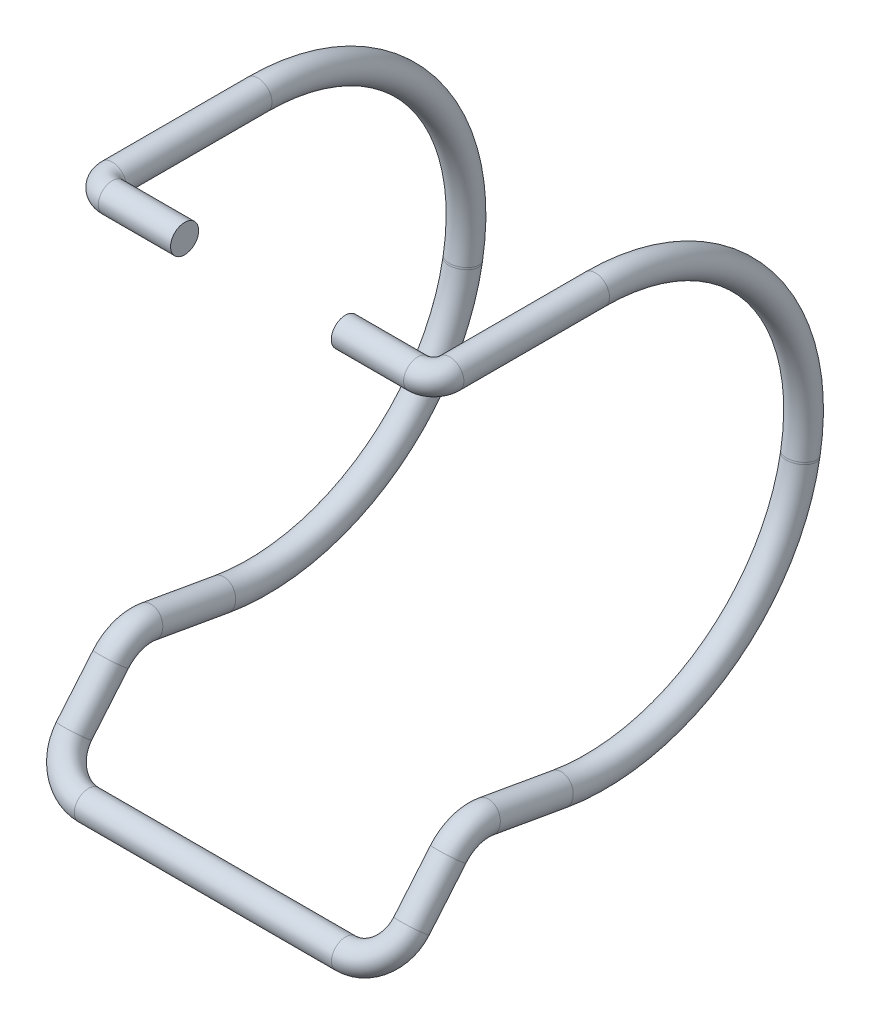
ISO-10303-21;
HEADER;
FILE_DESCRIPTION(('STEP AP214'),'2;1');
FILE_NAME('part.step','',(''),(''),'','','');
FILE_SCHEMA(('AUTOMOTIVE_DESIGN { 1 0 10303 214 1 1 1 1 }'));
ENDSEC;
DATA;
#1=APPLICATION_CONTEXT('core data for automotive mechanical design processes');
#2=APPLICATION_PROTOCOL_DEFINITION('international standard','automotive_design',2000,#1);
#3=PRODUCT_CONTEXT('',#1,'mechanical');
#4=PRODUCT('Part','Part','',(#3));
#5=PRODUCT_RELATED_PRODUCT_CATEGORY('part','',(#4));
#6=PRODUCT_DEFINITION_FORMATION('','',#4);
#7=PRODUCT_DEFINITION_CONTEXT('part definition',#1,'design');
#8=PRODUCT_DEFINITION('design','',#6,#7);
#9=PRODUCT_DEFINITION_SHAPE('','',#8);
#10=(LENGTH_UNIT() NAMED_UNIT(*) SI_UNIT(.MILLI.,.METRE.));
#11=(NAMED_UNIT(*) PLANE_ANGLE_UNIT() SI_UNIT($,.RADIAN.));
#12=(NAMED_UNIT(*) SI_UNIT($,.STERADIAN.) SOLID_ANGLE_UNIT());
#13=UNCERTAINTY_MEASURE_WITH_UNIT(LENGTH_MEASURE(1.E-05),#10,'distance_accuracy_value','');
#14=(GEOMETRIC_REPRESENTATION_CONTEXT(3) GLOBAL_UNCERTAINTY_ASSIGNED_CONTEXT((#13)) GLOBAL_UNIT_ASSIGNED_CONTEXT((#10,
#11,#12)) REPRESENTATION_CONTEXT('',''));
#15=CARTESIAN_POINT('',(0.,0.,0.));
#16=DIRECTION('',(0.,0.,1.));
#17=DIRECTION('',(1.,0.,0.));
#18=AXIS2_PLACEMENT_3D('',#15,#16,#17);
#19=CARTESIAN_POINT('',(19.,0.,0.));
#20=DIRECTION('',(-1.,0.,0.));
#21=DIRECTION('',(0.,0.,1.));
#22=AXIS2_PLACEMENT_3D('',#19,#20,#21);
#23=CYLINDRICAL_SURFACE('',#22,1.75);
#24=CARTESIAN_POINT('',(10.,0.,0.));
#25=DIRECTION('',(1.,0.,0.));
#26=DIRECTION('',(0.,1.,0.));
#27=AXIS2_PLACEMENT_3D('',#24,#25,#26);
#28=CIRCLE('',#27,1.75);
#29=CARTESIAN_POINT('',(10.,1.75,0.));
#30=VERTEX_POINT('',#29);
#31=EDGE_CURVE('E35',#30,#30,#28,.T.);
#32=ORIENTED_EDGE('',*,*,#31,.T.);
#33=EDGE_LOOP('',(#32));
#34=FACE_BOUND('',#33,.T.);
#35=CARTESIAN_POINT('',(19.,0.,0.));
#36=DIRECTION('',(1.,0.,0.));
#37=DIRECTION('',(0.,0.,-1.));
#38=AXIS2_PLACEMENT_3D('',#35,#36,#37);
#39=CIRCLE('',#38,1.75);
#40=CARTESIAN_POINT('',(19.,0.,1.75));
#41=VERTEX_POINT('',#40);
#42=EDGE_CURVE('E52',#41,#41,#39,.T.);
#43=ORIENTED_EDGE('',*,*,#42,.F.);
#44=EDGE_LOOP('',(#43));
#45=FACE_BOUND('',#44,.T.);
#46=ADVANCED_FACE('F31',(#34,#45),#23,.T.);
#47=CARTESIAN_POINT('',(-19.,0.,-2.));
#48=DIRECTION('',(0.,1.,0.));
#49=DIRECTION('',(0.,0.,1.));
#50=AXIS2_PLACEMENT_3D('',#47,#48,#49);
#51=TOROIDAL_SURFACE('',#50,1.99999999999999,1.75);
#52=CARTESIAN_POINT('',(-21.,0.,-1.99999999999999));
#53=DIRECTION('',(0.,0.,1.));
#54=DIRECTION('',(1.,0.,0.));
#55=AXIS2_PLACEMENT_3D('',#52,#53,#54);
#56=CIRCLE('',#55,1.75);
#57=CARTESIAN_POINT('',(-22.75,0.,-1.99999999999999));
#58=VERTEX_POINT('',#57);
#59=EDGE_CURVE('E39',#58,#58,#56,.T.);
#60=CARTESIAN_POINT('',(-19.,0.,0.));
#61=DIRECTION('',(1.,0.,0.));
#62=DIRECTION('',(0.,0.,-1.));
#63=AXIS2_PLACEMENT_3D('',#60,#61,#62);
#64=CIRCLE('',#63,1.75);
#65=CARTESIAN_POINT('',(-19.,0.,1.75));
#66=VERTEX_POINT('',#65);
#67=EDGE_CURVE('E10',#66,#66,#64,.T.);
#68=CARTESIAN_POINT('',(-19.,0.,-2.));
#69=DIRECTION('',(0.,1.,0.));
#70=DIRECTION('',(0.,0.,1.));
#71=AXIS2_PLACEMENT_3D('',#68,#69,#70);
#72=CIRCLE('',#71,3.74999999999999);
#73=EDGE_CURVE('',#58,#66,#72,.T.);
#74=ORIENTED_EDGE('',*,*,#59,.T.);
#75=ORIENTED_EDGE('',*,*,#67,.F.);
#76=ORIENTED_EDGE('',*,*,#73,.T.);
#77=ORIENTED_EDGE('',*,*,#73,.F.);
#78=EDGE_LOOP('',(#74,#76,#75,#77));
#79=FACE_BOUND('',#78,.T.);
#80=ADVANCED_FACE('F33',(#79),#51,.T.);
#81=CARTESIAN_POINT('',(-21.,0.,-20.1191753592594));
#82=DIRECTION('',(0.,0.,1.));
#83=DIRECTION('',(0.,-1.,0.));
#84=AXIS2_PLACEMENT_3D('',#81,#82,#83);
#85=CYLINDRICAL_SURFACE('',#84,1.75);
#86=CARTESIAN_POINT('',(-21.,0.,-20.1191753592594));
#87=DIRECTION('',(0.,0.,1.));
#88=DIRECTION('',(1.,0.,0.));
#89=AXIS2_PLACEMENT_3D('',#86,#87,#88);
#90=CIRCLE('',#89,1.75);
#91=CARTESIAN_POINT('',(-21.,1.75000000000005,-20.1191753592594));
#92=VERTEX_POINT('',#91);
#93=EDGE_CURVE('E44',#92,#92,#90,.T.);
#94=ORIENTED_EDGE('',*,*,#93,.T.);
#95=EDGE_LOOP('',(#94));
#96=FACE_BOUND('',#95,.T.);
#97=ORIENTED_EDGE('',*,*,#59,.F.);
#98=EDGE_LOOP('',(#97));
#99=FACE_BOUND('',#98,.T.);
#100=ADVANCED_FACE('F110',(#96,#99),#85,.T.);
#101=CARTESIAN_POINT('',(-21.,-25.9,-20.1191753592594));
#102=DIRECTION('',(1.,0.,0.));
#103=DIRECTION('',(0.,1.,0.));
#104=AXIS2_PLACEMENT_3D('',#101,#102,#103);
#105=TOROIDAL_SURFACE('',#104,25.9,1.75);
#106=CARTESIAN_POINT('',(-21.,-30.3974878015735,-45.6256961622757));
#107=DIRECTION('',(0.,0.984807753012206,-0.173648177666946));
#108=DIRECTION('',(1.,0.,0.));
#109=AXIS2_PLACEMENT_3D('',#106,#107,#108);
#110=CIRCLE('',#109,1.75);
#111=CARTESIAN_POINT('',(-21.,-30.7013721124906,-47.349109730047));
#112=VERTEX_POINT('',#111);
#113=EDGE_CURVE('E105',#112,#112,#110,.T.);
#114=CARTESIAN_POINT('',(-21.,-25.9,-20.1191753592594));
#115=DIRECTION('',(1.,0.,0.));
#116=DIRECTION('',(0.,1.,0.));
#117=AXIS2_PLACEMENT_3D('',#114,#115,#116);
#118=CIRCLE('',#117,27.65);
#119=EDGE_CURVE('',#112,#92,#118,.T.);
#120=ORIENTED_EDGE('',*,*,#113,.T.);
#121=ORIENTED_EDGE('',*,*,#93,.F.);
#122=ORIENTED_EDGE('',*,*,#119,.T.);
#123=ORIENTED_EDGE('',*,*,#119,.F.);
#124=EDGE_LOOP('',(#120,#122,#121,#123));
#125=FACE_BOUND('',#124,.T.);
#126=ADVANCED_FACE('F113',(#125),#105,.T.);
#127=CARTESIAN_POINT('',(-21.,-30.6133333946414,-45.5876367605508));
#128=DIRECTION('',(0.,0.984807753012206,-0.173648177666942));
#129=DIRECTION('',(0.,0.173648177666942,0.984807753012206));
#130=AXIS2_PLACEMENT_3D('',#127,#128,#129);
#131=CYLINDRICAL_SURFACE('',#130,1.75);
#132=CARTESIAN_POINT('',(-21.,-30.6133333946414,-45.5876367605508));
#133=DIRECTION('',(0.,0.984807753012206,-0.173648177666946));
#134=DIRECTION('',(1.,0.,0.));
#135=AXIS2_PLACEMENT_3D('',#132,#133,#134);
#136=CIRCLE('',#135,1.75);
#137=CARTESIAN_POINT('',(-21.,-30.9172177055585,-47.3110503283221));
#138=VERTEX_POINT('',#137);
#139=EDGE_CURVE('E102',#138,#138,#136,.T.);
#140=ORIENTED_EDGE('',*,*,#139,.T.);
#141=EDGE_LOOP('',(#140));
#142=FACE_BOUND('',#141,.T.);
#143=ORIENTED_EDGE('',*,*,#113,.F.);
#144=EDGE_LOOP('',(#143));
#145=FACE_BOUND('',#144,.T.);
#146=ADVANCED_FACE('F115',(#142,#145),#131,.T.);
#147=CARTESIAN_POINT('',(-21.,-26.1158455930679,-20.0811159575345));
#148=DIRECTION('',(1.,0.,0.));
#149=DIRECTION('',(0.,0.,-1.));
#150=AXIS2_PLACEMENT_3D('',#147,#148,#149);
#151=TOROIDAL_SURFACE('',#150,25.9,1.75);
#152=CARTESIAN_POINT('',(-21.,-51.6223663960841,-15.583628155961));
#153=DIRECTION('',(0.,-0.173648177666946,-0.984807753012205));
#154=DIRECTION('',(1.,0.,0.));
#155=AXIS2_PLACEMENT_3D('',#152,#153,#154);
#156=CIRCLE('',#155,1.75);
#157=CARTESIAN_POINT('',(-21.,-53.3457799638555,-15.2797438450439));
#158=VERTEX_POINT('',#157);
#159=EDGE_CURVE('E99',#158,#158,#156,.T.);
#160=CARTESIAN_POINT('',(-21.,-26.1158455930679,-20.0811159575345));
#161=DIRECTION('',(1.,0.,0.));
#162=DIRECTION('',(0.,0.,-1.));
#163=AXIS2_PLACEMENT_3D('',#160,#161,#162);
#164=CIRCLE('',#163,27.65);
#165=EDGE_CURVE('',#158,#138,#164,.T.);
#166=ORIENTED_EDGE('',*,*,#159,.T.);
#167=ORIENTED_EDGE('',*,*,#139,.F.);
#168=ORIENTED_EDGE('',*,*,#165,.T.);
#169=ORIENTED_EDGE('',*,*,#165,.F.);
#170=EDGE_LOOP('',(#166,#168,#167,#169));
#171=FACE_BOUND('',#170,.T.);
#172=ADVANCED_FACE('F122',(#171),#151,.T.);
#173=CARTESIAN_POINT('',(-21.,-50.0225025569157,-6.51034945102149));
#174=DIRECTION('',(0.,-0.17364817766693,-0.984807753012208));
#175=DIRECTION('',(0.,0.984807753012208,-0.17364817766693));
#176=AXIS2_PLACEMENT_3D('',#173,#174,#175);
#177=CYLINDRICAL_SURFACE('',#176,1.75);
#178=CARTESIAN_POINT('',(-21.,-50.0225025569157,-6.51034945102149));
#179=DIRECTION('',(0.,-0.173648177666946,-0.984807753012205));
#180=DIRECTION('',(1.,0.,0.));
#181=AXIS2_PLACEMENT_3D('',#178,#179,#180);
#182=CIRCLE('',#181,1.75);
#183=CARTESIAN_POINT('',(-21.,-48.2990889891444,-6.81423376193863));
#184=VERTEX_POINT('',#183);
#185=EDGE_CURVE('E96',#184,#184,#182,.T.);
#186=ORIENTED_EDGE('',*,*,#185,.T.);
#187=EDGE_LOOP('',(#186));
#188=FACE_BOUND('',#187,.T.);
#189=ORIENTED_EDGE('',*,*,#159,.F.);
#190=EDGE_LOOP('',(#189));
#191=FACE_BOUND('',#190,.T.);
#192=ADVANCED_FACE('F196',(#188,#191),#177,.T.);
#193=CARTESIAN_POINT('',(-21.,-54.9465413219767,-5.64210856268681));
#194=DIRECTION('',(-1.,0.,0.));
#195=DIRECTION('',(0.,0.,1.));
#196=AXIS2_PLACEMENT_3D('',#193,#194,#195);
#197=TOROIDAL_SURFACE('',#196,4.99999999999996,1.75);
#198=CARTESIAN_POINT('',(-21.,-51.7326032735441,-1.81188634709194));
#199=DIRECTION('',(0.,0.766044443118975,-0.642787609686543));
#200=DIRECTION('',(1.,0.,0.));
#201=AXIS2_PLACEMENT_3D('',#198,#199,#200);
#202=CIRCLE('',#201,1.75);
#203=CARTESIAN_POINT('',(-21.,-50.6077249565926,-0.471308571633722));
#204=VERTEX_POINT('',#203);
#205=EDGE_CURVE('E93',#204,#204,#202,.T.);
#206=CARTESIAN_POINT('',(-21.,-54.9465413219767,-5.64210856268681));
#207=DIRECTION('',(-1.,0.,0.));
#208=DIRECTION('',(0.,0.,1.));
#209=AXIS2_PLACEMENT_3D('',#206,#207,#208);
#210=CIRCLE('',#209,6.74999999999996);
#211=EDGE_CURVE('',#204,#184,#210,.T.);
#212=ORIENTED_EDGE('',*,*,#205,.T.);
#213=ORIENTED_EDGE('',*,*,#185,.F.);
#214=ORIENTED_EDGE('',*,*,#211,.T.);
#215=ORIENTED_EDGE('',*,*,#211,.F.);
#216=EDGE_LOOP('',(#212,#214,#213,#215));
#217=FACE_BOUND('',#216,.T.);
#218=ADVANCED_FACE('F192',(#217),#197,.T.);
#219=CARTESIAN_POINT('',(-21.,-57.181667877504,2.76042175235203));
#220=DIRECTION('',(0.,0.766044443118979,-0.642787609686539));
#221=DIRECTION('',(0.,0.642787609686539,0.766044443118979));
#222=AXIS2_PLACEMENT_3D('',#219,#220,#221);
#223=CYLINDRICAL_SURFACE('',#222,1.75);
#224=CARTESIAN_POINT('',(-21.,-57.181667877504,2.76042175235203));
#225=DIRECTION('',(0.,0.766044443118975,-0.642787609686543));
#226=DIRECTION('',(1.,0.,0.));
#227=AXIS2_PLACEMENT_3D('',#224,#225,#226);
#228=CIRCLE('',#227,1.75);
#229=CARTESIAN_POINT('',(-22.75,-57.181667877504,2.76042175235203));
#230=VERTEX_POINT('',#229);
#231=EDGE_CURVE('E90',#230,#230,#228,.T.);
#232=ORIENTED_EDGE('',*,*,#231,.T.);
#233=EDGE_LOOP('',(#232));
#234=FACE_BOUND('',#233,.T.);
#235=ORIENTED_EDGE('',*,*,#205,.F.);
#236=EDGE_LOOP('',(#235));
#237=FACE_BOUND('',#236,.T.);
#238=ADVANCED_FACE('F188',(#234,#237),#223,.T.);
#239=CARTESIAN_POINT('',(-16.,-57.1816678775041,2.76042175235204));
#240=DIRECTION('',(0.,-0.642787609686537,-0.76604444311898));
#241=DIRECTION('',(0.,0.76604444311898,-0.642787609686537));
#242=AXIS2_PLACEMENT_3D('',#239,#240,#241);
#243=TOROIDAL_SURFACE('',#242,4.99999999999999,1.75);
#244=CARTESIAN_POINT('',(-16.,-61.0118900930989,5.97435980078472));
#245=DIRECTION('',(-1.,0.,0.));
#246=DIRECTION('',(0.,0.76604444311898,-0.642787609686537));
#247=AXIS2_PLACEMENT_3D('',#244,#245,#246);
#248=CIRCLE('',#247,1.75);
#249=CARTESIAN_POINT('',(-16.,-62.3524678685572,7.09923811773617));
#250=VERTEX_POINT('',#249);
#251=EDGE_CURVE('E87',#250,#250,#248,.T.);
#252=CARTESIAN_POINT('',(-16.,-57.1816678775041,2.76042175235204));
#253=DIRECTION('',(0.,-0.642787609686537,-0.76604444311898));
#254=DIRECTION('',(0.,0.76604444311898,-0.642787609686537));
#255=AXIS2_PLACEMENT_3D('',#252,#253,#254);
#256=CIRCLE('',#255,6.74999999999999);
#257=EDGE_CURVE('',#250,#230,#256,.T.);
#258=ORIENTED_EDGE('',*,*,#251,.T.);
#259=ORIENTED_EDGE('',*,*,#231,.F.);
#260=ORIENTED_EDGE('',*,*,#257,.T.);
#261=ORIENTED_EDGE('',*,*,#257,.F.);
#262=EDGE_LOOP('',(#258,#260,#259,#261));
#263=FACE_BOUND('',#262,.T.);
#264=ADVANCED_FACE('F184',(#263),#243,.T.);
#265=CARTESIAN_POINT('',(16.,-61.0118900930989,5.97435980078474));
#266=DIRECTION('',(-1.,0.,0.));
#267=DIRECTION('',(0.,0.,1.));
#268=AXIS2_PLACEMENT_3D('',#265,#266,#267);
#269=CYLINDRICAL_SURFACE('',#268,1.75);
#270=CARTESIAN_POINT('',(16.,-61.0118900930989,5.97435980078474));
#271=DIRECTION('',(-1.,0.,0.));
#272=DIRECTION('',(0.,0.76604444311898,-0.642787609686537));
#273=AXIS2_PLACEMENT_3D('',#270,#271,#272);
#274=CIRCLE('',#273,1.75);
#275=CARTESIAN_POINT('',(16.,-62.3524678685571,7.09923811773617));
#276=VERTEX_POINT('',#275);
#277=EDGE_CURVE('E84',#276,#276,#274,.T.);
#278=ORIENTED_EDGE('',*,*,#277,.T.);
#279=EDGE_LOOP('',(#278));
#280=FACE_BOUND('',#279,.T.);
#281=ORIENTED_EDGE('',*,*,#251,.F.);
#282=EDGE_LOOP('',(#281));
#283=FACE_BOUND('',#282,.T.);
#284=ADVANCED_FACE('F180',(#280,#283),#269,.T.);
#285=CARTESIAN_POINT('',(16.,-57.181667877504,2.76042175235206));
#286=DIRECTION('',(0.,-0.642787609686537,-0.76604444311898));
#287=DIRECTION('',(0.,0.76604444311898,-0.642787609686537));
#288=AXIS2_PLACEMENT_3D('',#285,#286,#287);
#289=TOROIDAL_SURFACE('',#288,4.99999999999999,1.75);
#290=CARTESIAN_POINT('',(21.,-57.1816678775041,2.76042175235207));
#291=DIRECTION('',(0.,-0.766044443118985,0.642787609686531));
#292=DIRECTION('',(-1.,0.,0.));
#293=AXIS2_PLACEMENT_3D('',#290,#291,#292);
#294=CIRCLE('',#293,1.75);
#295=CARTESIAN_POINT('',(22.75,-57.1816678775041,2.76042175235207));
#296=VERTEX_POINT('',#295);
#297=EDGE_CURVE('E81',#296,#296,#294,.T.);
#298=CARTESIAN_POINT('',(16.,-57.181667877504,2.76042175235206));
#299=DIRECTION('',(0.,-0.642787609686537,-0.76604444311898));
#300=DIRECTION('',(0.,0.76604444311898,-0.642787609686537));
#301=AXIS2_PLACEMENT_3D('',#298,#299,#300);
#302=CIRCLE('',#301,6.74999999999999);
#303=EDGE_CURVE('',#296,#276,#302,.T.);
#304=ORIENTED_EDGE('',*,*,#297,.T.);
#305=ORIENTED_EDGE('',*,*,#277,.F.);
#306=ORIENTED_EDGE('',*,*,#303,.T.);
#307=ORIENTED_EDGE('',*,*,#303,.F.);
#308=EDGE_LOOP('',(#304,#306,#305,#307));
#309=FACE_BOUND('',#308,.T.);
#310=ADVANCED_FACE('F176',(#309),#289,.T.);
#311=CARTESIAN_POINT('',(21.,-51.7326032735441,-1.8118863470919));
#312=DIRECTION('',(0.,-0.76604444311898,0.642787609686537));
#313=DIRECTION('',(0.,-0.642787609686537,-0.76604444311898));
#314=AXIS2_PLACEMENT_3D('',#311,#312,#313);
#315=CYLINDRICAL_SURFACE('',#314,1.75);
#316=CARTESIAN_POINT('',(21.,-51.7326032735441,-1.8118863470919));
#317=DIRECTION('',(0.,-0.766044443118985,0.642787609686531));
#318=DIRECTION('',(-1.,0.,0.));
#319=AXIS2_PLACEMENT_3D('',#316,#317,#318);
#320=CIRCLE('',#319,1.75);
#321=CARTESIAN_POINT('',(21.,-50.6077249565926,-0.471308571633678));
#322=VERTEX_POINT('',#321);
#323=EDGE_CURVE('E78',#322,#322,#320,.T.);
#324=ORIENTED_EDGE('',*,*,#323,.T.);
#325=EDGE_LOOP('',(#324));
#326=FACE_BOUND('',#325,.T.);
#327=ORIENTED_EDGE('',*,*,#297,.F.);
#328=EDGE_LOOP('',(#327));
#329=FACE_BOUND('',#328,.T.);
#330=ADVANCED_FACE('F172',(#326,#329),#315,.T.);
#331=CARTESIAN_POINT('',(21.,-54.9465413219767,-5.64210856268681));
#332=DIRECTION('',(1.,0.,0.));
#333=DIRECTION('',(0.,0.,-1.));
#334=AXIS2_PLACEMENT_3D('',#331,#332,#333);
#335=TOROIDAL_SURFACE('',#334,5.,1.75);
#336=CARTESIAN_POINT('',(21.,-50.0225025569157,-6.51034945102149));
#337=DIRECTION('',(0.,0.17364817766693,0.984807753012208));
#338=DIRECTION('',(-1.,0.,0.));
#339=AXIS2_PLACEMENT_3D('',#336,#337,#338);
#340=CIRCLE('',#339,1.75);
#341=CARTESIAN_POINT('',(21.,-48.2990889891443,-6.81423376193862));
#342=VERTEX_POINT('',#341);
#343=EDGE_CURVE('E75',#342,#342,#340,.T.);
#344=CARTESIAN_POINT('',(21.,-54.9465413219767,-5.64210856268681));
#345=DIRECTION('',(1.,0.,0.));
#346=DIRECTION('',(0.,0.,-1.));
#347=AXIS2_PLACEMENT_3D('',#344,#345,#346);
#348=CIRCLE('',#347,6.75);
#349=EDGE_CURVE('',#342,#322,#348,.T.);
#350=ORIENTED_EDGE('',*,*,#343,.T.);
#351=ORIENTED_EDGE('',*,*,#323,.F.);
#352=ORIENTED_EDGE('',*,*,#349,.T.);
#353=ORIENTED_EDGE('',*,*,#349,.F.);
#354=EDGE_LOOP('',(#350,#352,#351,#353));
#355=FACE_BOUND('',#354,.T.);
#356=ADVANCED_FACE('F168',(#355),#335,.T.);
#357=CARTESIAN_POINT('',(21.,-51.6223663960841,-15.5836281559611));
#358=DIRECTION('',(0.,0.17364817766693,0.984807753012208));
#359=DIRECTION('',(0.,-0.984807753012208,0.17364817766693));
#360=AXIS2_PLACEMENT_3D('',#357,#358,#359);
#361=CYLINDRICAL_SURFACE('',#360,1.75);
#362=CARTESIAN_POINT('',(21.,-51.6223663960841,-15.5836281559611));
#363=DIRECTION('',(0.,0.17364817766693,0.984807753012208));
#364=DIRECTION('',(-1.,0.,0.));
#365=AXIS2_PLACEMENT_3D('',#362,#363,#364);
#366=CIRCLE('',#365,1.75);
#367=CARTESIAN_POINT('',(21.,-53.3457799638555,-15.2797438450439));
#368=VERTEX_POINT('',#367);
#369=EDGE_CURVE('E72',#368,#368,#366,.T.);
#370=ORIENTED_EDGE('',*,*,#369,.T.);
#371=EDGE_LOOP('',(#370));
#372=FACE_BOUND('',#371,.T.);
#373=ORIENTED_EDGE('',*,*,#343,.F.);
#374=EDGE_LOOP('',(#373));
#375=FACE_BOUND('',#374,.T.);
#376=ADVANCED_FACE('F164',(#372,#375),#361,.T.);
#377=CARTESIAN_POINT('',(21.,-26.1158455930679,-20.0811159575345));
#378=DIRECTION('',(-1.,0.,0.));
#379=DIRECTION('',(0.,-1.,0.));
#380=AXIS2_PLACEMENT_3D('',#377,#378,#379);
#381=TOROIDAL_SURFACE('',#380,25.9,1.75);
#382=CARTESIAN_POINT('',(21.,-30.6133333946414,-45.5876367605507));
#383=DIRECTION('',(0.,-0.984807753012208,0.173648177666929));
#384=DIRECTION('',(-1.,0.,0.));
#385=AXIS2_PLACEMENT_3D('',#382,#383,#384);
#386=CIRCLE('',#385,1.75);
#387=CARTESIAN_POINT('',(21.,-30.9172177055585,-47.3110503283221));
#388=VERTEX_POINT('',#387);
#389=EDGE_CURVE('E69',#388,#388,#386,.T.);
#390=CARTESIAN_POINT('',(21.,-26.1158455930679,-20.0811159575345));
#391=DIRECTION('',(-1.,0.,0.));
#392=DIRECTION('',(0.,-1.,0.));
#393=AXIS2_PLACEMENT_3D('',#390,#391,#392);
#394=CIRCLE('',#393,27.65);
#395=EDGE_CURVE('',#388,#368,#394,.T.);
#396=ORIENTED_EDGE('',*,*,#389,.T.);
#397=ORIENTED_EDGE('',*,*,#369,.F.);
#398=ORIENTED_EDGE('',*,*,#395,.T.);
#399=ORIENTED_EDGE('',*,*,#395,.F.);
#400=EDGE_LOOP('',(#396,#398,#397,#399));
#401=FACE_BOUND('',#400,.T.);
#402=ADVANCED_FACE('F160',(#401),#381,.T.);
#403=CARTESIAN_POINT('',(21.,-30.3974878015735,-45.6256961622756));
#404=DIRECTION('',(0.,-0.984807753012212,0.17364817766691));
#405=DIRECTION('',(0.,-0.17364817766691,-0.984807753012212));
#406=AXIS2_PLACEMENT_3D('',#403,#404,#405);
#407=CYLINDRICAL_SURFACE('',#406,1.75);
#408=CARTESIAN_POINT('',(21.,-30.3974878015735,-45.6256961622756));
#409=DIRECTION('',(0.,-0.984807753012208,0.173648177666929));
#410=DIRECTION('',(-1.,0.,0.));
#411=AXIS2_PLACEMENT_3D('',#408,#409,#410);
#412=CIRCLE('',#411,1.75);
#413=CARTESIAN_POINT('',(21.,-30.7013721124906,-47.349109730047));
#414=VERTEX_POINT('',#413);
#415=EDGE_CURVE('E66',#414,#414,#412,.T.);
#416=ORIENTED_EDGE('',*,*,#415,.T.);
#417=EDGE_LOOP('',(#416));
#418=FACE_BOUND('',#417,.T.);
#419=ORIENTED_EDGE('',*,*,#389,.F.);
#420=EDGE_LOOP('',(#419));
#421=FACE_BOUND('',#420,.T.);
#422=ADVANCED_FACE('F156',(#418,#421),#407,.T.);
#423=CARTESIAN_POINT('',(21.,-25.9,-20.1191753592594));
#424=DIRECTION('',(-1.,0.,0.));
#425=DIRECTION('',(0.,0.,1.));
#426=AXIS2_PLACEMENT_3D('',#423,#424,#425);
#427=TOROIDAL_SURFACE('',#426,25.9,1.75);
#428=CARTESIAN_POINT('',(21.,0.,-20.1191753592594));
#429=DIRECTION('',(0.,0.,-1.));
#430=DIRECTION('',(-1.,0.,0.));
#431=AXIS2_PLACEMENT_3D('',#428,#429,#430);
#432=CIRCLE('',#431,1.75);
#433=CARTESIAN_POINT('',(21.,1.75,-20.1191753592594));
#434=VERTEX_POINT('',#433);
#435=EDGE_CURVE('E61',#434,#434,#432,.T.);
#436=CARTESIAN_POINT('',(21.,-25.9,-20.1191753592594));
#437=DIRECTION('',(-1.,0.,0.));
#438=DIRECTION('',(0.,0.,1.));
#439=AXIS2_PLACEMENT_3D('',#436,#437,#438);
#440=CIRCLE('',#439,27.65);
#441=EDGE_CURVE('',#434,#414,#440,.T.);
#442=ORIENTED_EDGE('',*,*,#435,.T.);
#443=ORIENTED_EDGE('',*,*,#415,.F.);
#444=ORIENTED_EDGE('',*,*,#441,.T.);
#445=ORIENTED_EDGE('',*,*,#441,.F.);
#446=EDGE_LOOP('',(#442,#444,#443,#445));
#447=FACE_BOUND('',#446,.T.);
#448=ADVANCED_FACE('F149',(#447),#427,.T.);
#449=CARTESIAN_POINT('',(21.,0.,-2.));
#450=DIRECTION('',(0.,0.,-1.));
#451=DIRECTION('',(0.,1.,0.));
#452=AXIS2_PLACEMENT_3D('',#449,#450,#451);
#453=CYLINDRICAL_SURFACE('',#452,1.75);
#454=CARTESIAN_POINT('',(21.,0.,-2.));
#455=DIRECTION('',(0.,0.,-1.));
#456=DIRECTION('',(-1.,0.,0.));
#457=AXIS2_PLACEMENT_3D('',#454,#455,#456);
#458=CIRCLE('',#457,1.75);
#459=CARTESIAN_POINT('',(22.75,0.,-2.));
#460=VERTEX_POINT('',#459);
#461=EDGE_CURVE('E56',#460,#460,#458,.T.);
#462=ORIENTED_EDGE('',*,*,#461,.T.);
#463=EDGE_LOOP('',(#462));
#464=FACE_BOUND('',#463,.T.);
#465=ORIENTED_EDGE('',*,*,#435,.F.);
#466=EDGE_LOOP('',(#465));
#467=FACE_BOUND('',#466,.T.);
#468=ADVANCED_FACE('F145',(#464,#467),#453,.T.);
#469=CARTESIAN_POINT('',(19.,0.,-2.));
#470=DIRECTION('',(0.,1.,0.));
#471=DIRECTION('',(0.,0.,1.));
#472=AXIS2_PLACEMENT_3D('',#469,#470,#471);
#473=TOROIDAL_SURFACE('',#472,2.,1.75);
#474=CARTESIAN_POINT('',(19.,0.,-2.));
#475=DIRECTION('',(0.,1.,0.));
#476=DIRECTION('',(0.,0.,1.));
#477=AXIS2_PLACEMENT_3D('',#474,#475,#476);
#478=CIRCLE('',#477,3.75);
#479=EDGE_CURVE('',#41,#460,#478,.T.);
#480=ORIENTED_EDGE('',*,*,#42,.T.);
#481=ORIENTED_EDGE('',*,*,#461,.F.);
#482=ORIENTED_EDGE('',*,*,#479,.T.);
#483=ORIENTED_EDGE('',*,*,#479,.F.);
#484=EDGE_LOOP('',(#480,#482,#481,#483));
#485=FACE_BOUND('',#484,.T.);
#486=ADVANCED_FACE('F137',(#485),#473,.T.);
#487=CARTESIAN_POINT('',(-10.,0.,0.));
#488=DIRECTION('',(-1.,0.,0.));
#489=DIRECTION('',(0.,-1.,0.));
#490=AXIS2_PLACEMENT_3D('',#487,#488,#489);
#491=CIRCLE('',#490,1.75);
#492=CARTESIAN_POINT('',(-10.,-1.75,0.));
#493=VERTEX_POINT('',#492);
#494=EDGE_CURVE('E47',#493,#493,#491,.T.);
#495=ORIENTED_EDGE('',*,*,#494,.T.);
#496=EDGE_LOOP('',(#495));
#497=FACE_BOUND('',#496,.T.);
#498=ORIENTED_EDGE('',*,*,#67,.T.);
#499=EDGE_LOOP('',(#498));
#500=FACE_BOUND('',#499,.T.);
#501=ADVANCED_FACE('F127',(#497,#500),#23,.T.);
#502=CARTESIAN_POINT('',(-10.,5.,-47.7691753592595));
#503=DIRECTION('',(-1.,0.,0.));
#504=DIRECTION('',(0.,-1.,0.));
#505=AXIS2_PLACEMENT_3D('',#502,#503,#504);
#506=PLANE('',#505);
#507=ORIENTED_EDGE('',*,*,#494,.F.);
#508=EDGE_LOOP('',(#507));
#509=FACE_BOUND('',#508,.T.);
#510=ADVANCED_FACE('F136',(#509),#506,.F.);
#511=CARTESIAN_POINT('',(10.,5.,-47.7691753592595));
#512=DIRECTION('',(1.,0.,0.));
#513=DIRECTION('',(0.,1.,0.));
#514=AXIS2_PLACEMENT_3D('',#511,#512,#513);
#515=PLANE('',#514);
#516=ORIENTED_EDGE('',*,*,#31,.F.);
#517=EDGE_LOOP('',(#516));
#518=FACE_BOUND('',#517,.T.);
#519=ADVANCED_FACE('F142',(#518),#515,.F.);
#520=CLOSED_SHELL('',(#46,#80,#100,#126,#146,#172,#192,#218,#238,#264,#284,#310,#330,#356,#376,
#402,#422,#448,#468,#486,#501,#510,#519));
#521=MANIFOLD_SOLID_BREP('B2',#520);
#522=ADVANCED_BREP_SHAPE_REPRESENTATION('',(#18,#521),#14);
#523=SHAPE_DEFINITION_REPRESENTATION(#9,#522);
ENDSEC;
END-ISO-10303-21;
